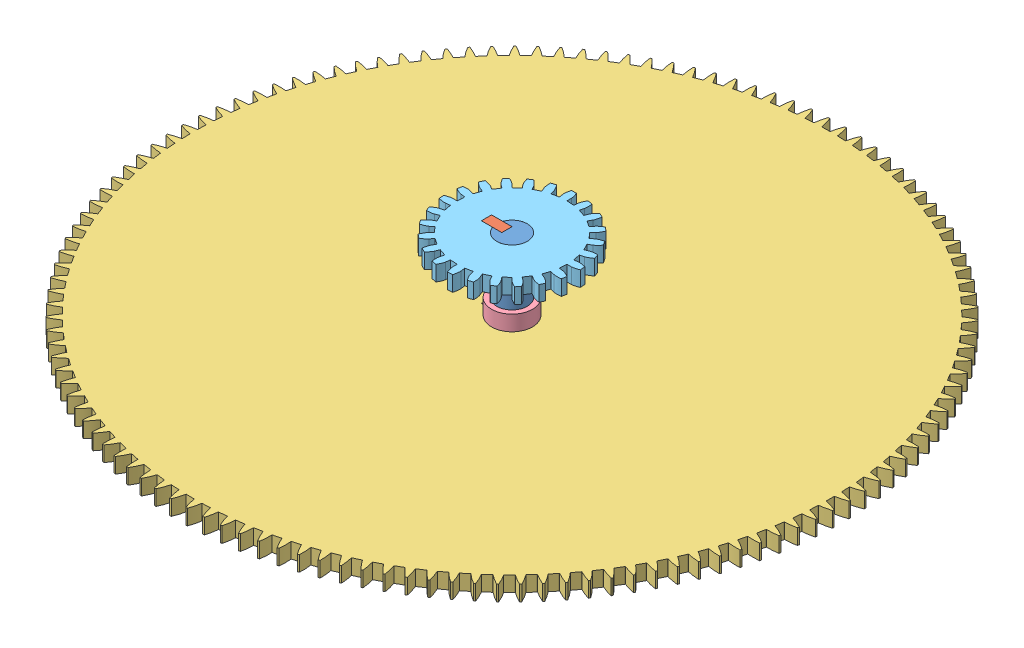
SolidWorks assembly Axle Assembly D.SLDASM, configuration Default (file format 6000). Lengths in mm.
Overall size (64.49 8.55 64.5).
6 component instances, 5 part files, 15 mates.
Components (placement in the parent):
- Axle D-1: Axle D.SLDPRT [Default] at (-8.3948 0.8688 -4.7649) size (3 8.5 3)
- Key-1: Key.SLDPRT [Default] at (-8.3948 3.8688 -4.7649) size (2 1.5 1)
- Gear 127T-1: Gear 127T.sldprt [Default] at (-6.8948 -3.1312 -4.7649) x (0 0 -1) z (1 0 0) size (64.5 1.6 64.49)
- Key-2: Key.SLDPRT [Default] at (-8.3948 -3.1312 -4.7649) size (2 1.5 1)
- Spacer 1.5mm-1: Spacer 1.5mm.SLDPRT [Default] at (-6.8948 -0.1312 -4.7649) x (-1 0 0) z (0 0 1) size (4 1.5 4)
- Gear 24T-1: Gear 24T.sldprt [Default] at (-6.8948 3.8688 -4.7649) x (0 0 -1) z (1 0 0) size (12.99 1.5 12.99)
Mates (geometry in assembly coordinates):
- Coincident1: coincident aligned: plane of Key-1 through (-9.3948 5.3688 -4.2649) normal (0 0 1); plane of Key-2 through (-9.3948 -1.6312 -4.2649) normal (0 0 1)
- Coincident2: coincident aligned: plane of Key-1 through (-9.3948 5.3688 -4.2649) normal (-1 0 0); plane of Key-2 through (-9.3948 -1.6312 -4.2649) normal (-1 0 0)
- Coincident3: coincident anti-aligned: plane of Axle D-1 through (-7.3948 3.8688 -5.2649) normal (0 1 0); plane of Key-1 through (-8.3948 3.8688 -4.7649) normal (0 -1 0)
- Coincident4: coincident anti-aligned: plane of Axle D-1 through (-7.3948 -1.6312 -4.7649) normal (0 -1 0); plane of Key-2 through (-8.3948 -1.6312 -4.7649) normal (0 1 0)
- Coincident5: coincident anti-aligned: plane of Axle D-1 through (-7.3948 0.8688 -4.7649) normal (-1 0 0); plane of Key-2 through (-7.3948 -1.6312 -4.2649) normal (1 0 0)
- Coincident6: coincident anti-aligned: plane of Axle D-1 through (-7.3948 0.8688 -4.2649) normal (0 0 -1); plane of Key-2 through (-9.3948 -1.6312 -4.2649) normal (0 0 1)
- Concentric2: concentric anti-aligned: cylinder of Axle D-1 through (-6.8948 5.3688 -4.7649) axis (0 -1 0) radius 1.5; cylinder of Spacer 1.5mm-1 through (-6.8948 -1.6312 -4.7649) axis (0 1 0) radius 1.5
- Parallel2: parallel aligned: line of Key-2 through (-9.3948 -1.6312 -5.2649) axis (0 0 1); line of Spacer 1.5mm-1 through (-6.8948 -0.1312 -4.7649) axis (0 0 1)
- Coincident7: coincident aligned: plane of Gear 127T-1 through (2.121 -3.1312 36.4854) normal (0 -1 0); plane of Key-2 through (-8.3948 -3.1312 -4.7649) normal (0 -1 0)
- Concentric3: concentric aligned: cylinder of Axle D-1 through (-6.8948 5.3688 -4.7649) axis (0 -1 0) radius 1.5; cylinder of Gear 127T-1 through (-6.8948 -1.6312 -4.7649) axis (0 -1 0) radius 1.5
- Coincident8: coincident aligned: line of Gear 127T-1 through (-9.3948 -3.1312 -5.2649) axis (0 0 1); line of Key-2 through (-9.3948 -3.1312 -5.2649) axis (0 0 1)
- Coincident9: coincident aligned: plane of Key-1 through (-8.3948 5.3688 -4.7649) normal (0 1 0); plane of Gear 24T-1 through (-4.0774 5.3688 4.3289) normal (0 1 0)
- Concentric4: concentric aligned: cylinder of Axle D-1 through (-6.8948 5.3688 -4.7649) axis (0 -1 0) radius 1.5; cylinder of Gear 24T-1 through (-6.8948 5.3688 -4.7649) axis (0 -1 0) radius 1.5
- Parallel3: parallel aligned: line of Key-1 through (-9.3948 5.3688 -5.2649) axis (0 0 1); line of Gear 24T-1 through (-9.3948 5.3688 -5.2649) axis (0 0 1)
- Coincident13: coincident anti-aligned: plane of Key-2 through (-8.3948 -1.6312 -4.7649) normal (0 1 0); plane of Spacer 1.5mm-1 through (-6.8948 -1.6312 -4.7649) normal (0 -1 0)
